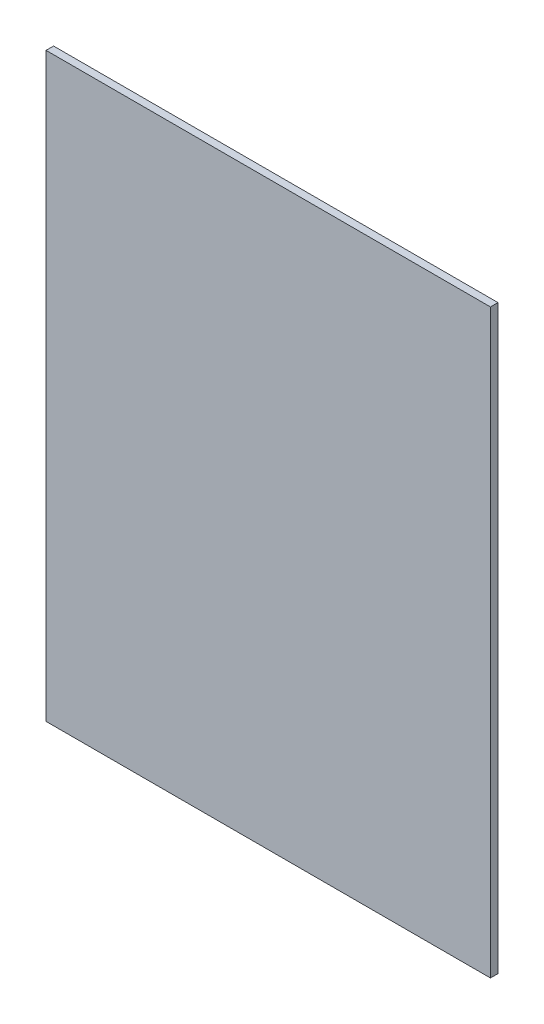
ISO-10303-21;
HEADER;
FILE_DESCRIPTION(('STEP AP214'),'2;1');
FILE_NAME('part.step','',(''),(''),'','','');
FILE_SCHEMA(('AUTOMOTIVE_DESIGN { 1 0 10303 214 1 1 1 1 }'));
ENDSEC;
DATA;
#1=APPLICATION_CONTEXT('core data for automotive mechanical design processes');
#2=APPLICATION_PROTOCOL_DEFINITION('international standard','automotive_design',2000,#1);
#3=PRODUCT_CONTEXT('',#1,'mechanical');
#4=PRODUCT('Part','Part','',(#3));
#5=PRODUCT_RELATED_PRODUCT_CATEGORY('part','',(#4));
#6=PRODUCT_DEFINITION_FORMATION('','',#4);
#7=PRODUCT_DEFINITION_CONTEXT('part definition',#1,'design');
#8=PRODUCT_DEFINITION('design','',#6,#7);
#9=PRODUCT_DEFINITION_SHAPE('','',#8);
#10=(LENGTH_UNIT() NAMED_UNIT(*) SI_UNIT(.MILLI.,.METRE.));
#11=(NAMED_UNIT(*) PLANE_ANGLE_UNIT() SI_UNIT($,.RADIAN.));
#12=(NAMED_UNIT(*) SI_UNIT($,.STERADIAN.) SOLID_ANGLE_UNIT());
#13=UNCERTAINTY_MEASURE_WITH_UNIT(LENGTH_MEASURE(1.E-05),#10,'distance_accuracy_value','');
#14=(GEOMETRIC_REPRESENTATION_CONTEXT(3) GLOBAL_UNCERTAINTY_ASSIGNED_CONTEXT((#13)) GLOBAL_UNIT_ASSIGNED_CONTEXT((#10,
#11,#12)) REPRESENTATION_CONTEXT('',''));
#15=CARTESIAN_POINT('',(0.,0.,0.));
#16=DIRECTION('',(0.,0.,1.));
#17=DIRECTION('',(1.,0.,0.));
#18=AXIS2_PLACEMENT_3D('',#15,#16,#17);
#19=CARTESIAN_POINT('',(82.55,107.95,2.794));
#20=DIRECTION('',(-1.,0.,0.));
#21=DIRECTION('',(0.,-1.,0.));
#22=AXIS2_PLACEMENT_3D('',#19,#20,#21);
#23=PLANE('',#22);
#24=DIRECTION('',(0.,1.,0.));
#25=VECTOR('',#24,1.);
#26=CARTESIAN_POINT('',(82.55,107.95,0.));
#27=LINE('',#26,#25);
#28=CARTESIAN_POINT('',(82.55,-107.95,0.));
#29=VERTEX_POINT('',#28);
#30=CARTESIAN_POINT('',(82.55,107.95,0.));
#31=VERTEX_POINT('',#30);
#32=EDGE_CURVE('E96',#29,#31,#27,.T.);
#33=ORIENTED_EDGE('',*,*,#32,.T.);
#34=DIRECTION('',(0.,0.,-1.));
#35=VECTOR('',#34,1.);
#36=CARTESIAN_POINT('',(82.55,107.95,2.794));
#37=LINE('',#36,#35);
#38=CARTESIAN_POINT('',(82.55,107.95,2.794));
#39=VERTEX_POINT('',#38);
#40=EDGE_CURVE('E11',#39,#31,#37,.T.);
#41=ORIENTED_EDGE('',*,*,#40,.F.);
#42=DIRECTION('',(0.,1.,0.));
#43=VECTOR('',#42,1.);
#44=CARTESIAN_POINT('',(82.55,107.95,2.794));
#45=LINE('',#44,#43);
#46=CARTESIAN_POINT('',(82.55,-107.95,2.794));
#47=VERTEX_POINT('',#46);
#48=EDGE_CURVE('E84',#47,#39,#45,.T.);
#49=ORIENTED_EDGE('',*,*,#48,.F.);
#50=DIRECTION('',(0.,0.,-1.));
#51=VECTOR('',#50,1.);
#52=CARTESIAN_POINT('',(82.55,-107.95,2.794));
#53=LINE('',#52,#51);
#54=EDGE_CURVE('E92',#47,#29,#53,.T.);
#55=ORIENTED_EDGE('',*,*,#54,.T.);
#56=EDGE_LOOP('',(#33,#41,#49,#55));
#57=FACE_BOUND('',#56,.T.);
#58=ADVANCED_FACE('F33',(#57),#23,.F.);
#59=CARTESIAN_POINT('',(-82.55,107.95,2.794));
#60=DIRECTION('',(0.,-1.,0.));
#61=DIRECTION('',(0.,0.,-1.));
#62=AXIS2_PLACEMENT_3D('',#59,#60,#61);
#63=PLANE('',#62);
#64=DIRECTION('',(-1.,0.,0.));
#65=VECTOR('',#64,1.);
#66=CARTESIAN_POINT('',(-82.55,107.95,0.));
#67=LINE('',#66,#65);
#68=CARTESIAN_POINT('',(-82.55,107.95,0.));
#69=VERTEX_POINT('',#68);
#70=EDGE_CURVE('E88',#31,#69,#67,.T.);
#71=ORIENTED_EDGE('',*,*,#70,.T.);
#72=DIRECTION('',(0.,0.,-1.));
#73=VECTOR('',#72,1.);
#74=CARTESIAN_POINT('',(-82.55,107.95,2.794));
#75=LINE('',#74,#73);
#76=CARTESIAN_POINT('',(-82.55,107.95,2.794));
#77=VERTEX_POINT('',#76);
#78=EDGE_CURVE('E41',#77,#69,#75,.T.);
#79=ORIENTED_EDGE('',*,*,#78,.F.);
#80=DIRECTION('',(-1.,0.,0.));
#81=VECTOR('',#80,1.);
#82=CARTESIAN_POINT('',(-82.55,107.95,2.794));
#83=LINE('',#82,#81);
#84=EDGE_CURVE('E79',#39,#77,#83,.T.);
#85=ORIENTED_EDGE('',*,*,#84,.F.);
#86=ORIENTED_EDGE('',*,*,#40,.T.);
#87=EDGE_LOOP('',(#71,#79,#85,#86));
#88=FACE_BOUND('',#87,.T.);
#89=ADVANCED_FACE('F87',(#88),#63,.F.);
#90=CARTESIAN_POINT('',(-82.55,107.95,2.794));
#91=DIRECTION('',(1.,0.,0.));
#92=DIRECTION('',(0.,1.,0.));
#93=AXIS2_PLACEMENT_3D('',#90,#91,#92);
#94=PLANE('',#93);
#95=DIRECTION('',(0.,-1.,0.));
#96=VECTOR('',#95,1.);
#97=CARTESIAN_POINT('',(-82.55,107.95,0.));
#98=LINE('',#97,#96);
#99=CARTESIAN_POINT('',(-82.55,-107.95,0.));
#100=VERTEX_POINT('',#99);
#101=EDGE_CURVE('E66',#69,#100,#98,.T.);
#102=ORIENTED_EDGE('',*,*,#101,.T.);
#103=DIRECTION('',(0.,0.,-1.));
#104=VECTOR('',#103,1.);
#105=CARTESIAN_POINT('',(-82.55,-107.95,2.794));
#106=LINE('',#105,#104);
#107=CARTESIAN_POINT('',(-82.55,-107.95,2.794));
#108=VERTEX_POINT('',#107);
#109=EDGE_CURVE('E89',#108,#100,#106,.T.);
#110=ORIENTED_EDGE('',*,*,#109,.F.);
#111=DIRECTION('',(0.,-1.,0.));
#112=VECTOR('',#111,1.);
#113=CARTESIAN_POINT('',(-82.55,107.95,2.794));
#114=LINE('',#113,#112);
#115=EDGE_CURVE('E82',#77,#108,#114,.T.);
#116=ORIENTED_EDGE('',*,*,#115,.F.);
#117=ORIENTED_EDGE('',*,*,#78,.T.);
#118=EDGE_LOOP('',(#102,#110,#116,#117));
#119=FACE_BOUND('',#118,.T.);
#120=ADVANCED_FACE('F90',(#119),#94,.F.);
#121=CARTESIAN_POINT('',(-82.55,-107.95,2.794));
#122=DIRECTION('',(0.,1.,0.));
#123=DIRECTION('',(0.,0.,1.));
#124=AXIS2_PLACEMENT_3D('',#121,#122,#123);
#125=PLANE('',#124);
#126=DIRECTION('',(1.,0.,0.));
#127=VECTOR('',#126,1.);
#128=CARTESIAN_POINT('',(-82.55,-107.95,0.));
#129=LINE('',#128,#127);
#130=EDGE_CURVE('E72',#100,#29,#129,.T.);
#131=ORIENTED_EDGE('',*,*,#130,.T.);
#132=ORIENTED_EDGE('',*,*,#54,.F.);
#133=DIRECTION('',(1.,0.,0.));
#134=VECTOR('',#133,1.);
#135=CARTESIAN_POINT('',(-82.55,-107.95,2.794));
#136=LINE('',#135,#134);
#137=EDGE_CURVE('E49',#108,#47,#136,.T.);
#138=ORIENTED_EDGE('',*,*,#137,.F.);
#139=ORIENTED_EDGE('',*,*,#109,.T.);
#140=EDGE_LOOP('',(#131,#132,#138,#139));
#141=FACE_BOUND('',#140,.T.);
#142=ADVANCED_FACE('F103',(#141),#125,.F.);
#143=CARTESIAN_POINT('',(0.,0.,2.794));
#144=DIRECTION('',(0.,0.,1.));
#145=DIRECTION('',(1.,0.,0.));
#146=AXIS2_PLACEMENT_3D('',#143,#144,#145);
#147=PLANE('',#146);
#148=ORIENTED_EDGE('',*,*,#48,.T.);
#149=ORIENTED_EDGE('',*,*,#84,.T.);
#150=ORIENTED_EDGE('',*,*,#115,.T.);
#151=ORIENTED_EDGE('',*,*,#137,.T.);
#152=EDGE_LOOP('',(#148,#149,#150,#151));
#153=FACE_BOUND('',#152,.T.);
#154=ADVANCED_FACE('F80',(#153),#147,.T.);
#155=CARTESIAN_POINT('',(0.,0.,0.));
#156=DIRECTION('',(0.,0.,1.));
#157=DIRECTION('',(1.,0.,0.));
#158=AXIS2_PLACEMENT_3D('',#155,#156,#157);
#159=PLANE('',#158);
#160=ORIENTED_EDGE('',*,*,#32,.F.);
#161=ORIENTED_EDGE('',*,*,#130,.F.);
#162=ORIENTED_EDGE('',*,*,#101,.F.);
#163=ORIENTED_EDGE('',*,*,#70,.F.);
#164=EDGE_LOOP('',(#160,#161,#162,#163));
#165=FACE_BOUND('',#164,.T.);
#166=ADVANCED_FACE('F106',(#165),#159,.F.);
#167=CLOSED_SHELL('',(#58,#89,#120,#142,#154,#166));
#168=MANIFOLD_SOLID_BREP('B2',#167);
#169=ADVANCED_BREP_SHAPE_REPRESENTATION('',(#18,#168),#14);
#170=SHAPE_DEFINITION_REPRESENTATION(#9,#169);
ENDSEC;
END-ISO-10303-21;
